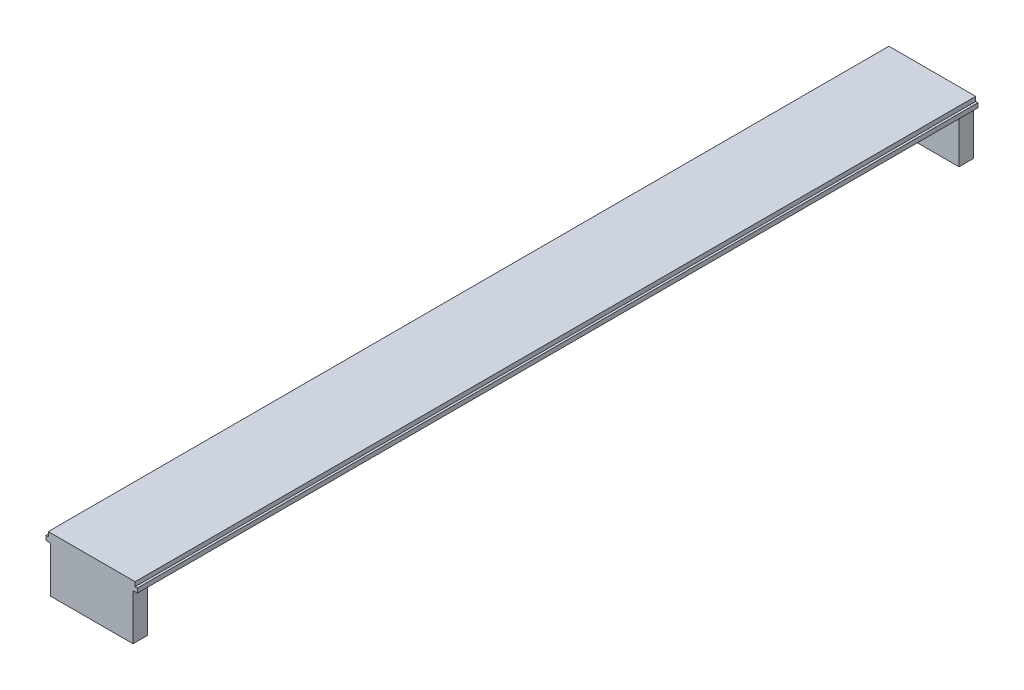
ISO-10303-21;
HEADER;
FILE_DESCRIPTION(('STEP AP214'),'2;1');
FILE_NAME('part.step','',(''),(''),'','','');
FILE_SCHEMA(('AUTOMOTIVE_DESIGN { 1 0 10303 214 1 1 1 1 }'));
ENDSEC;
DATA;
#1=APPLICATION_CONTEXT('core data for automotive mechanical design processes');
#2=APPLICATION_PROTOCOL_DEFINITION('international standard','automotive_design',2000,#1);
#3=PRODUCT_CONTEXT('',#1,'mechanical');
#4=PRODUCT('Part','Part','',(#3));
#5=PRODUCT_RELATED_PRODUCT_CATEGORY('part','',(#4));
#6=PRODUCT_DEFINITION_FORMATION('','',#4);
#7=PRODUCT_DEFINITION_CONTEXT('part definition',#1,'design');
#8=PRODUCT_DEFINITION('design','',#6,#7);
#9=PRODUCT_DEFINITION_SHAPE('','',#8);
#10=(LENGTH_UNIT() NAMED_UNIT(*) SI_UNIT(.MILLI.,.METRE.));
#11=(NAMED_UNIT(*) PLANE_ANGLE_UNIT() SI_UNIT($,.RADIAN.));
#12=(NAMED_UNIT(*) SI_UNIT($,.STERADIAN.) SOLID_ANGLE_UNIT());
#13=UNCERTAINTY_MEASURE_WITH_UNIT(LENGTH_MEASURE(1.E-05),#10,'distance_accuracy_value','');
#14=(GEOMETRIC_REPRESENTATION_CONTEXT(3) GLOBAL_UNCERTAINTY_ASSIGNED_CONTEXT((#13)) GLOBAL_UNIT_ASSIGNED_CONTEXT((#10,
#11,#12)) REPRESENTATION_CONTEXT('',''));
#15=CARTESIAN_POINT('',(0.,0.,0.));
#16=DIRECTION('',(0.,0.,1.));
#17=DIRECTION('',(1.,0.,0.));
#18=AXIS2_PLACEMENT_3D('',#15,#16,#17);
#19=CARTESIAN_POINT('',(0.,0.,146.05));
#20=DIRECTION('',(0.,1.,0.));
#21=DIRECTION('',(0.,0.,1.));
#22=AXIS2_PLACEMENT_3D('',#19,#20,#21);
#23=PLANE('',#22);
#24=DIRECTION('',(0.,0.,1.));
#25=VECTOR('',#24,1.);
#26=CARTESIAN_POINT('',(15.113,0.,0.));
#27=LINE('',#26,#25);
#28=CARTESIAN_POINT('',(15.113,0.,0.));
#29=VERTEX_POINT('',#28);
#30=CARTESIAN_POINT('',(15.113,0.,2.53999999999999));
#31=VERTEX_POINT('',#30);
#32=EDGE_CURVE('E319',#29,#31,#27,.T.);
#33=ORIENTED_EDGE('',*,*,#32,.F.);
#34=DIRECTION('',(1.,0.,0.));
#35=VECTOR('',#34,1.);
#36=CARTESIAN_POINT('',(0.,0.,0.));
#37=LINE('',#36,#35);
#38=CARTESIAN_POINT('',(15.875,0.,0.));
#39=VERTEX_POINT('',#38);
#40=EDGE_CURVE('E172',#29,#39,#37,.T.);
#41=ORIENTED_EDGE('',*,*,#40,.T.);
#42=DIRECTION('',(0.,0.,-1.));
#43=VECTOR('',#42,1.);
#44=CARTESIAN_POINT('',(15.875,0.,146.05));
#45=LINE('',#44,#43);
#46=CARTESIAN_POINT('',(15.875,0.,146.05));
#47=VERTEX_POINT('',#46);
#48=EDGE_CURVE('E44',#47,#39,#45,.T.);
#49=ORIENTED_EDGE('',*,*,#48,.F.);
#50=DIRECTION('',(1.,0.,0.));
#51=VECTOR('',#50,1.);
#52=CARTESIAN_POINT('',(0.,0.,146.05));
#53=LINE('',#52,#51);
#54=CARTESIAN_POINT('',(15.113,0.,146.05));
#55=VERTEX_POINT('',#54);
#56=EDGE_CURVE('E218',#55,#47,#53,.T.);
#57=ORIENTED_EDGE('',*,*,#56,.F.);
#58=DIRECTION('',(0.,0.,1.));
#59=VECTOR('',#58,1.);
#60=CARTESIAN_POINT('',(15.113,0.,146.05));
#61=LINE('',#60,#59);
#62=CARTESIAN_POINT('',(15.113,0.,143.51));
#63=VERTEX_POINT('',#62);
#64=EDGE_CURVE('E186',#63,#55,#61,.T.);
#65=ORIENTED_EDGE('',*,*,#64,.F.);
#66=DIRECTION('',(1.,0.,0.));
#67=VECTOR('',#66,1.);
#68=CARTESIAN_POINT('',(0.762000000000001,0.,143.51));
#69=LINE('',#68,#67);
#70=CARTESIAN_POINT('',(0.762000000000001,0.,143.51));
#71=VERTEX_POINT('',#70);
#72=EDGE_CURVE('E176',#71,#63,#69,.T.);
#73=ORIENTED_EDGE('',*,*,#72,.F.);
#74=DIRECTION('',(0.,0.,-1.));
#75=VECTOR('',#74,1.);
#76=CARTESIAN_POINT('',(0.762000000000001,0.,146.05));
#77=LINE('',#76,#75);
#78=CARTESIAN_POINT('',(0.762000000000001,0.,146.05));
#79=VERTEX_POINT('',#78);
#80=EDGE_CURVE('E173',#79,#71,#77,.T.);
#81=ORIENTED_EDGE('',*,*,#80,.F.);
#82=CARTESIAN_POINT('',(0.,0.,146.05));
#83=VERTEX_POINT('',#82);
#84=EDGE_CURVE('E221',#83,#79,#53,.T.);
#85=ORIENTED_EDGE('',*,*,#84,.F.);
#86=DIRECTION('',(0.,0.,-1.));
#87=VECTOR('',#86,1.);
#88=CARTESIAN_POINT('',(0.,0.,146.05));
#89=LINE('',#88,#87);
#90=CARTESIAN_POINT('',(0.,0.,0.));
#91=VERTEX_POINT('',#90);
#92=EDGE_CURVE('E11',#83,#91,#89,.T.);
#93=ORIENTED_EDGE('',*,*,#92,.T.);
#94=CARTESIAN_POINT('',(0.762000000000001,0.,0.));
#95=VERTEX_POINT('',#94);
#96=EDGE_CURVE('E243',#91,#95,#37,.T.);
#97=ORIENTED_EDGE('',*,*,#96,.T.);
#98=DIRECTION('',(0.,0.,-1.));
#99=VECTOR('',#98,1.);
#100=CARTESIAN_POINT('',(0.762000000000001,0.,0.));
#101=LINE('',#100,#99);
#102=CARTESIAN_POINT('',(0.762000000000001,0.,2.53999999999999));
#103=VERTEX_POINT('',#102);
#104=EDGE_CURVE('E57',#103,#95,#101,.T.);
#105=ORIENTED_EDGE('',*,*,#104,.F.);
#106=DIRECTION('',(-1.,0.,0.));
#107=VECTOR('',#106,1.);
#108=CARTESIAN_POINT('',(0.762000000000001,0.,2.53999999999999));
#109=LINE('',#108,#107);
#110=EDGE_CURVE('E52',#31,#103,#109,.T.);
#111=ORIENTED_EDGE('',*,*,#110,.F.);
#112=EDGE_LOOP('',(#33,#41,#49,#57,#65,#73,#81,#85,#93,#97,#105,#111));
#113=FACE_BOUND('',#112,.T.);
#114=ADVANCED_FACE('F35',(#113),#23,.F.);
#115=CARTESIAN_POINT('',(0.,0.,146.05));
#116=DIRECTION('',(1.,0.,0.));
#117=DIRECTION('',(0.,0.,-1.));
#118=AXIS2_PLACEMENT_3D('',#115,#116,#117);
#119=PLANE('',#118);
#120=DIRECTION('',(0.,-1.,0.));
#121=VECTOR('',#120,1.);
#122=CARTESIAN_POINT('',(0.,0.,0.));
#123=LINE('',#122,#121);
#124=CARTESIAN_POINT('',(0.,0.762,0.));
#125=VERTEX_POINT('',#124);
#126=EDGE_CURVE('E240',#125,#91,#123,.T.);
#127=ORIENTED_EDGE('',*,*,#126,.T.);
#128=ORIENTED_EDGE('',*,*,#92,.F.);
#129=DIRECTION('',(0.,-1.,0.));
#130=VECTOR('',#129,1.);
#131=CARTESIAN_POINT('',(0.,0.,146.05));
#132=LINE('',#131,#130);
#133=CARTESIAN_POINT('',(0.,0.762,146.05));
#134=VERTEX_POINT('',#133);
#135=EDGE_CURVE('E222',#134,#83,#132,.T.);
#136=ORIENTED_EDGE('',*,*,#135,.F.);
#137=DIRECTION('',(0.,0.,-1.));
#138=VECTOR('',#137,1.);
#139=CARTESIAN_POINT('',(0.,0.762,146.05));
#140=LINE('',#139,#138);
#141=EDGE_CURVE('E239',#134,#125,#140,.T.);
#142=ORIENTED_EDGE('',*,*,#141,.T.);
#143=EDGE_LOOP('',(#127,#128,#136,#142));
#144=FACE_BOUND('',#143,.T.);
#145=ADVANCED_FACE('F37',(#144),#119,.F.);
#146=CARTESIAN_POINT('',(15.875,0.,146.05));
#147=DIRECTION('',(-1.,0.,0.));
#148=DIRECTION('',(0.,0.,1.));
#149=AXIS2_PLACEMENT_3D('',#146,#147,#148);
#150=PLANE('',#149);
#151=DIRECTION('',(0.,1.,0.));
#152=VECTOR('',#151,1.);
#153=CARTESIAN_POINT('',(15.875,0.,0.));
#154=LINE('',#153,#152);
#155=CARTESIAN_POINT('',(15.875,0.762,0.));
#156=VERTEX_POINT('',#155);
#157=EDGE_CURVE('E245',#39,#156,#154,.T.);
#158=ORIENTED_EDGE('',*,*,#157,.T.);
#159=DIRECTION('',(0.,0.,-1.));
#160=VECTOR('',#159,1.);
#161=CARTESIAN_POINT('',(15.875,0.762,146.05));
#162=LINE('',#161,#160);
#163=CARTESIAN_POINT('',(15.875,0.762,146.05));
#164=VERTEX_POINT('',#163);
#165=EDGE_CURVE('E271',#164,#156,#162,.T.);
#166=ORIENTED_EDGE('',*,*,#165,.F.);
#167=DIRECTION('',(0.,1.,0.));
#168=VECTOR('',#167,1.);
#169=CARTESIAN_POINT('',(15.875,0.,146.05));
#170=LINE('',#169,#168);
#171=EDGE_CURVE('E226',#47,#164,#170,.T.);
#172=ORIENTED_EDGE('',*,*,#171,.F.);
#173=ORIENTED_EDGE('',*,*,#48,.T.);
#174=EDGE_LOOP('',(#158,#166,#172,#173));
#175=FACE_BOUND('',#174,.T.);
#176=ADVANCED_FACE('F278',(#175),#150,.F.);
#177=CARTESIAN_POINT('',(15.875,0.762,146.05));
#178=DIRECTION('',(0.,-1.,0.));
#179=DIRECTION('',(0.,0.,-1.));
#180=AXIS2_PLACEMENT_3D('',#177,#178,#179);
#181=PLANE('',#180);
#182=DIRECTION('',(-1.,0.,0.));
#183=VECTOR('',#182,1.);
#184=CARTESIAN_POINT('',(15.875,0.762,0.));
#185=LINE('',#184,#183);
#186=CARTESIAN_POINT('',(15.4813,0.762,0.));
#187=VERTEX_POINT('',#186);
#188=EDGE_CURVE('E247',#156,#187,#185,.T.);
#189=ORIENTED_EDGE('',*,*,#188,.T.);
#190=DIRECTION('',(0.,0.,-1.));
#191=VECTOR('',#190,1.);
#192=CARTESIAN_POINT('',(15.4813,0.762,146.05));
#193=LINE('',#192,#191);
#194=CARTESIAN_POINT('',(15.4813,0.762,146.05));
#195=VERTEX_POINT('',#194);
#196=EDGE_CURVE('E268',#195,#187,#193,.T.);
#197=ORIENTED_EDGE('',*,*,#196,.F.);
#198=DIRECTION('',(-1.,0.,0.));
#199=VECTOR('',#198,1.);
#200=CARTESIAN_POINT('',(15.875,0.762,146.05));
#201=LINE('',#200,#199);
#202=EDGE_CURVE('E229',#164,#195,#201,.T.);
#203=ORIENTED_EDGE('',*,*,#202,.F.);
#204=ORIENTED_EDGE('',*,*,#165,.T.);
#205=EDGE_LOOP('',(#189,#197,#203,#204));
#206=FACE_BOUND('',#205,.T.);
#207=ADVANCED_FACE('F285',(#206),#181,.F.);
#208=CARTESIAN_POINT('',(15.4813,1.524,146.05));
#209=DIRECTION('',(-1.,0.,0.));
#210=DIRECTION('',(0.,0.,1.));
#211=AXIS2_PLACEMENT_3D('',#208,#209,#210);
#212=PLANE('',#211);
#213=DIRECTION('',(0.,1.,0.));
#214=VECTOR('',#213,1.);
#215=CARTESIAN_POINT('',(15.4813,1.524,0.));
#216=LINE('',#215,#214);
#217=CARTESIAN_POINT('',(15.4813,1.524,0.));
#218=VERTEX_POINT('',#217);
#219=EDGE_CURVE('E249',#187,#218,#216,.T.);
#220=ORIENTED_EDGE('',*,*,#219,.T.);
#221=DIRECTION('',(0.,0.,-1.));
#222=VECTOR('',#221,1.);
#223=CARTESIAN_POINT('',(15.4813,1.524,146.05));
#224=LINE('',#223,#222);
#225=CARTESIAN_POINT('',(15.4813,1.524,146.05));
#226=VERTEX_POINT('',#225);
#227=EDGE_CURVE('E265',#226,#218,#224,.T.);
#228=ORIENTED_EDGE('',*,*,#227,.F.);
#229=DIRECTION('',(0.,1.,0.));
#230=VECTOR('',#229,1.);
#231=CARTESIAN_POINT('',(15.4813,1.524,146.05));
#232=LINE('',#231,#230);
#233=EDGE_CURVE('E231',#195,#226,#232,.T.);
#234=ORIENTED_EDGE('',*,*,#233,.F.);
#235=ORIENTED_EDGE('',*,*,#196,.T.);
#236=EDGE_LOOP('',(#220,#228,#234,#235));
#237=FACE_BOUND('',#236,.T.);
#238=ADVANCED_FACE('F289',(#237),#212,.F.);
#239=CARTESIAN_POINT('',(0.393699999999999,1.524,146.05));
#240=DIRECTION('',(0.,-1.,0.));
#241=DIRECTION('',(1.,0.,0.));
#242=AXIS2_PLACEMENT_3D('',#239,#240,#241);
#243=PLANE('',#242);
#244=DIRECTION('',(-1.,0.,0.));
#245=VECTOR('',#244,1.);
#246=CARTESIAN_POINT('',(0.393699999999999,1.524,0.));
#247=LINE('',#246,#245);
#248=CARTESIAN_POINT('',(0.393699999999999,1.524,0.));
#249=VERTEX_POINT('',#248);
#250=EDGE_CURVE('E251',#218,#249,#247,.T.);
#251=ORIENTED_EDGE('',*,*,#250,.T.);
#252=DIRECTION('',(0.,0.,-1.));
#253=VECTOR('',#252,1.);
#254=CARTESIAN_POINT('',(0.393699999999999,1.524,146.05));
#255=LINE('',#254,#253);
#256=CARTESIAN_POINT('',(0.393699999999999,1.524,146.05));
#257=VERTEX_POINT('',#256);
#258=EDGE_CURVE('E262',#257,#249,#255,.T.);
#259=ORIENTED_EDGE('',*,*,#258,.F.);
#260=DIRECTION('',(-1.,0.,0.));
#261=VECTOR('',#260,1.);
#262=CARTESIAN_POINT('',(0.393699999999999,1.524,146.05));
#263=LINE('',#262,#261);
#264=EDGE_CURVE('E233',#226,#257,#263,.T.);
#265=ORIENTED_EDGE('',*,*,#264,.F.);
#266=ORIENTED_EDGE('',*,*,#227,.T.);
#267=EDGE_LOOP('',(#251,#259,#265,#266));
#268=FACE_BOUND('',#267,.T.);
#269=ADVANCED_FACE('F358',(#268),#243,.F.);
#270=CARTESIAN_POINT('',(0.393699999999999,1.524,146.05));
#271=DIRECTION('',(1.,0.,0.));
#272=DIRECTION('',(0.,0.,-1.));
#273=AXIS2_PLACEMENT_3D('',#270,#271,#272);
#274=PLANE('',#273);
#275=DIRECTION('',(0.,-1.,0.));
#276=VECTOR('',#275,1.);
#277=CARTESIAN_POINT('',(0.393699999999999,1.524,0.));
#278=LINE('',#277,#276);
#279=CARTESIAN_POINT('',(0.393699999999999,0.762,0.));
#280=VERTEX_POINT('',#279);
#281=EDGE_CURVE('E253',#249,#280,#278,.T.);
#282=ORIENTED_EDGE('',*,*,#281,.T.);
#283=DIRECTION('',(0.,0.,-1.));
#284=VECTOR('',#283,1.);
#285=CARTESIAN_POINT('',(0.393699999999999,0.762,146.05));
#286=LINE('',#285,#284);
#287=CARTESIAN_POINT('',(0.393699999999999,0.762,146.05));
#288=VERTEX_POINT('',#287);
#289=EDGE_CURVE('E259',#288,#280,#286,.T.);
#290=ORIENTED_EDGE('',*,*,#289,.F.);
#291=DIRECTION('',(0.,-1.,0.));
#292=VECTOR('',#291,1.);
#293=CARTESIAN_POINT('',(0.393699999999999,1.524,146.05));
#294=LINE('',#293,#292);
#295=EDGE_CURVE('E235',#257,#288,#294,.T.);
#296=ORIENTED_EDGE('',*,*,#295,.F.);
#297=ORIENTED_EDGE('',*,*,#258,.T.);
#298=EDGE_LOOP('',(#282,#290,#296,#297));
#299=FACE_BOUND('',#298,.T.);
#300=ADVANCED_FACE('F361',(#299),#274,.F.);
#301=CARTESIAN_POINT('',(0.,0.762,146.05));
#302=DIRECTION('',(0.,-1.,0.));
#303=DIRECTION('',(0.,0.,-1.));
#304=AXIS2_PLACEMENT_3D('',#301,#302,#303);
#305=PLANE('',#304);
#306=DIRECTION('',(-1.,0.,0.));
#307=VECTOR('',#306,1.);
#308=CARTESIAN_POINT('',(0.,0.762,0.));
#309=LINE('',#308,#307);
#310=EDGE_CURVE('E255',#280,#125,#309,.T.);
#311=ORIENTED_EDGE('',*,*,#310,.T.);
#312=ORIENTED_EDGE('',*,*,#141,.F.);
#313=DIRECTION('',(-1.,0.,0.));
#314=VECTOR('',#313,1.);
#315=CARTESIAN_POINT('',(0.,0.762,146.05));
#316=LINE('',#315,#314);
#317=EDGE_CURVE('E237',#288,#134,#316,.T.);
#318=ORIENTED_EDGE('',*,*,#317,.F.);
#319=ORIENTED_EDGE('',*,*,#289,.T.);
#320=EDGE_LOOP('',(#311,#312,#318,#319));
#321=FACE_BOUND('',#320,.T.);
#322=ADVANCED_FACE('F365',(#321),#305,.F.);
#323=CARTESIAN_POINT('',(0.,0.,146.05));
#324=DIRECTION('',(0.,0.,-1.));
#325=DIRECTION('',(-1.,0.,0.));
#326=AXIS2_PLACEMENT_3D('',#323,#324,#325);
#327=PLANE('',#326);
#328=ORIENTED_EDGE('',*,*,#135,.T.);
#329=ORIENTED_EDGE('',*,*,#84,.T.);
#330=DIRECTION('',(0.,1.,0.));
#331=VECTOR('',#330,1.);
#332=CARTESIAN_POINT('',(0.762000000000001,-8.001,146.05));
#333=LINE('',#332,#331);
#334=CARTESIAN_POINT('',(0.762000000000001,-8.001,146.05));
#335=VERTEX_POINT('',#334);
#336=EDGE_CURVE('E192',#335,#79,#333,.T.);
#337=ORIENTED_EDGE('',*,*,#336,.F.);
#338=DIRECTION('',(-1.,0.,0.));
#339=VECTOR('',#338,1.);
#340=CARTESIAN_POINT('',(0.762000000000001,-8.001,146.05));
#341=LINE('',#340,#339);
#342=CARTESIAN_POINT('',(15.113,-8.001,146.05));
#343=VERTEX_POINT('',#342);
#344=EDGE_CURVE('E190',#343,#335,#341,.T.);
#345=ORIENTED_EDGE('',*,*,#344,.F.);
#346=DIRECTION('',(0.,1.,0.));
#347=VECTOR('',#346,1.);
#348=CARTESIAN_POINT('',(15.113,-8.001,146.05));
#349=LINE('',#348,#347);
#350=EDGE_CURVE('E204',#343,#55,#349,.T.);
#351=ORIENTED_EDGE('',*,*,#350,.T.);
#352=ORIENTED_EDGE('',*,*,#56,.T.);
#353=ORIENTED_EDGE('',*,*,#171,.T.);
#354=ORIENTED_EDGE('',*,*,#202,.T.);
#355=ORIENTED_EDGE('',*,*,#233,.T.);
#356=ORIENTED_EDGE('',*,*,#264,.T.);
#357=ORIENTED_EDGE('',*,*,#295,.T.);
#358=ORIENTED_EDGE('',*,*,#317,.T.);
#359=EDGE_LOOP('',(#328,#329,#337,#345,#351,#352,#353,#354,#355,#356,#357,#358));
#360=FACE_BOUND('',#359,.T.);
#361=ADVANCED_FACE('F293',(#360),#327,.F.);
#362=CARTESIAN_POINT('',(0.,0.,0.));
#363=DIRECTION('',(0.,0.,-1.));
#364=DIRECTION('',(-1.,0.,0.));
#365=AXIS2_PLACEMENT_3D('',#362,#363,#364);
#366=PLANE('',#365);
#367=CARTESIAN_POINT('',(7.9375,-3.2385,0.));
#368=DIRECTION('',(0.,0.,1.));
#369=DIRECTION('',(1.,0.,0.));
#370=AXIS2_PLACEMENT_3D('',#367,#368,#369);
#371=CIRCLE('',#370,2.38125);
#372=CARTESIAN_POINT('',(10.31875,-3.2385,0.));
#373=VERTEX_POINT('',#372);
#374=EDGE_CURVE('E320',#373,#373,#371,.T.);
#375=ORIENTED_EDGE('',*,*,#374,.T.);
#376=EDGE_LOOP('',(#375));
#377=FACE_BOUND('',#376,.T.);
#378=ORIENTED_EDGE('',*,*,#126,.F.);
#379=ORIENTED_EDGE('',*,*,#310,.F.);
#380=ORIENTED_EDGE('',*,*,#281,.F.);
#381=ORIENTED_EDGE('',*,*,#250,.F.);
#382=ORIENTED_EDGE('',*,*,#219,.F.);
#383=ORIENTED_EDGE('',*,*,#188,.F.);
#384=ORIENTED_EDGE('',*,*,#157,.F.);
#385=ORIENTED_EDGE('',*,*,#40,.F.);
#386=DIRECTION('',(0.,1.,0.));
#387=VECTOR('',#386,1.);
#388=CARTESIAN_POINT('',(15.113,-8.001,0.));
#389=LINE('',#388,#387);
#390=CARTESIAN_POINT('',(15.113,-8.001,0.));
#391=VERTEX_POINT('',#390);
#392=EDGE_CURVE('E153',#391,#29,#389,.T.);
#393=ORIENTED_EDGE('',*,*,#392,.F.);
#394=DIRECTION('',(1.,0.,0.));
#395=VECTOR('',#394,1.);
#396=CARTESIAN_POINT('',(0.762000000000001,-8.001,0.));
#397=LINE('',#396,#395);
#398=CARTESIAN_POINT('',(0.762000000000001,-8.001,0.));
#399=VERTEX_POINT('',#398);
#400=EDGE_CURVE('E159',#399,#391,#397,.T.);
#401=ORIENTED_EDGE('',*,*,#400,.F.);
#402=DIRECTION('',(0.,1.,0.));
#403=VECTOR('',#402,1.);
#404=CARTESIAN_POINT('',(0.762000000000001,-8.001,0.));
#405=LINE('',#404,#403);
#406=EDGE_CURVE('E312',#399,#95,#405,.T.);
#407=ORIENTED_EDGE('',*,*,#406,.T.);
#408=ORIENTED_EDGE('',*,*,#96,.F.);
#409=EDGE_LOOP('',(#378,#379,#380,#381,#382,#383,#384,#385,#393,#401,#407,#408));
#410=FACE_BOUND('',#409,.T.);
#411=ADVANCED_FACE('F170',(#377,#410),#366,.T.);
#412=CARTESIAN_POINT('',(0.762000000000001,-8.001,146.05));
#413=DIRECTION('',(1.,0.,0.));
#414=DIRECTION('',(0.,0.,-1.));
#415=AXIS2_PLACEMENT_3D('',#412,#413,#414);
#416=PLANE('',#415);
#417=ORIENTED_EDGE('',*,*,#80,.T.);
#418=DIRECTION('',(0.,1.,0.));
#419=VECTOR('',#418,1.);
#420=CARTESIAN_POINT('',(0.762000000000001,-8.001,143.51));
#421=LINE('',#420,#419);
#422=CARTESIAN_POINT('',(0.762000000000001,-8.001,143.51));
#423=VERTEX_POINT('',#422);
#424=EDGE_CURVE('E210',#423,#71,#421,.T.);
#425=ORIENTED_EDGE('',*,*,#424,.F.);
#426=DIRECTION('',(0.,0.,-1.));
#427=VECTOR('',#426,1.);
#428=CARTESIAN_POINT('',(0.762000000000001,-8.001,146.05));
#429=LINE('',#428,#427);
#430=EDGE_CURVE('E182',#335,#423,#429,.T.);
#431=ORIENTED_EDGE('',*,*,#430,.F.);
#432=ORIENTED_EDGE('',*,*,#336,.T.);
#433=EDGE_LOOP('',(#417,#425,#431,#432));
#434=FACE_BOUND('',#433,.T.);
#435=ADVANCED_FACE('F372',(#434),#416,.F.);
#436=CARTESIAN_POINT('',(0.762000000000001,-8.001,143.51));
#437=DIRECTION('',(0.,0.,1.));
#438=DIRECTION('',(1.,0.,0.));
#439=AXIS2_PLACEMENT_3D('',#436,#437,#438);
#440=PLANE('',#439);
#441=ORIENTED_EDGE('',*,*,#72,.T.);
#442=DIRECTION('',(0.,1.,0.));
#443=VECTOR('',#442,1.);
#444=CARTESIAN_POINT('',(15.113,-8.001,143.51));
#445=LINE('',#444,#443);
#446=CARTESIAN_POINT('',(15.113,-8.001,143.51));
#447=VERTEX_POINT('',#446);
#448=EDGE_CURVE('E197',#447,#63,#445,.T.);
#449=ORIENTED_EDGE('',*,*,#448,.F.);
#450=DIRECTION('',(1.,0.,0.));
#451=VECTOR('',#450,1.);
#452=CARTESIAN_POINT('',(0.762000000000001,-8.001,143.51));
#453=LINE('',#452,#451);
#454=EDGE_CURVE('E185',#423,#447,#453,.T.);
#455=ORIENTED_EDGE('',*,*,#454,.F.);
#456=ORIENTED_EDGE('',*,*,#424,.T.);
#457=EDGE_LOOP('',(#441,#449,#455,#456));
#458=FACE_BOUND('',#457,.T.);
#459=ADVANCED_FACE('F300',(#458),#440,.F.);
#460=CARTESIAN_POINT('',(15.113,-8.001,146.05));
#461=DIRECTION('',(-1.,0.,0.));
#462=DIRECTION('',(0.,0.,1.));
#463=AXIS2_PLACEMENT_3D('',#460,#461,#462);
#464=PLANE('',#463);
#465=ORIENTED_EDGE('',*,*,#64,.T.);
#466=ORIENTED_EDGE('',*,*,#350,.F.);
#467=DIRECTION('',(0.,0.,1.));
#468=VECTOR('',#467,1.);
#469=CARTESIAN_POINT('',(15.113,-8.001,146.05));
#470=LINE('',#469,#468);
#471=EDGE_CURVE('E188',#447,#343,#470,.T.);
#472=ORIENTED_EDGE('',*,*,#471,.F.);
#473=ORIENTED_EDGE('',*,*,#448,.T.);
#474=EDGE_LOOP('',(#465,#466,#472,#473));
#475=FACE_BOUND('',#474,.T.);
#476=ADVANCED_FACE('F296',(#475),#464,.F.);
#477=CARTESIAN_POINT('',(0.,-8.001,0.));
#478=DIRECTION('',(0.,-1.,0.));
#479=DIRECTION('',(0.,0.,-1.));
#480=AXIS2_PLACEMENT_3D('',#477,#478,#479);
#481=PLANE('',#480);
#482=ORIENTED_EDGE('',*,*,#430,.T.);
#483=ORIENTED_EDGE('',*,*,#454,.T.);
#484=ORIENTED_EDGE('',*,*,#471,.T.);
#485=ORIENTED_EDGE('',*,*,#344,.T.);
#486=EDGE_LOOP('',(#482,#483,#484,#485));
#487=FACE_BOUND('',#486,.T.);
#488=ADVANCED_FACE('F345',(#487),#481,.T.);
#489=CARTESIAN_POINT('',(15.113,-8.001,0.));
#490=DIRECTION('',(-1.,0.,0.));
#491=DIRECTION('',(0.,0.,1.));
#492=AXIS2_PLACEMENT_3D('',#489,#490,#491);
#493=PLANE('',#492);
#494=ORIENTED_EDGE('',*,*,#32,.T.);
#495=DIRECTION('',(0.,1.,0.));
#496=VECTOR('',#495,1.);
#497=CARTESIAN_POINT('',(15.113,-8.001,2.53999999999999));
#498=LINE('',#497,#496);
#499=CARTESIAN_POINT('',(15.113,-8.001,2.53999999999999));
#500=VERTEX_POINT('',#499);
#501=EDGE_CURVE('E155',#500,#31,#498,.T.);
#502=ORIENTED_EDGE('',*,*,#501,.F.);
#503=DIRECTION('',(0.,0.,1.));
#504=VECTOR('',#503,1.);
#505=CARTESIAN_POINT('',(15.113,-8.001,0.));
#506=LINE('',#505,#504);
#507=EDGE_CURVE('E149',#391,#500,#506,.T.);
#508=ORIENTED_EDGE('',*,*,#507,.F.);
#509=ORIENTED_EDGE('',*,*,#392,.T.);
#510=EDGE_LOOP('',(#494,#502,#508,#509));
#511=FACE_BOUND('',#510,.T.);
#512=ADVANCED_FACE('F151',(#511),#493,.F.);
#513=CARTESIAN_POINT('',(0.762000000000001,-8.001,2.53999999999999));
#514=DIRECTION('',(0.,0.,-1.));
#515=DIRECTION('',(-1.,0.,0.));
#516=AXIS2_PLACEMENT_3D('',#513,#514,#515);
#517=PLANE('',#516);
#518=CARTESIAN_POINT('',(7.9375,-3.2385,2.53999999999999));
#519=DIRECTION('',(0.,0.,1.));
#520=DIRECTION('',(1.,0.,0.));
#521=AXIS2_PLACEMENT_3D('',#518,#519,#520);
#522=CIRCLE('',#521,2.38125);
#523=CARTESIAN_POINT('',(10.31875,-3.2385,2.53999999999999));
#524=VERTEX_POINT('',#523);
#525=EDGE_CURVE('E323',#524,#524,#522,.T.);
#526=ORIENTED_EDGE('',*,*,#525,.F.);
#527=EDGE_LOOP('',(#526));
#528=FACE_BOUND('',#527,.T.);
#529=ORIENTED_EDGE('',*,*,#110,.T.);
#530=DIRECTION('',(0.,1.,0.));
#531=VECTOR('',#530,1.);
#532=CARTESIAN_POINT('',(0.762000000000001,-8.001,2.53999999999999));
#533=LINE('',#532,#531);
#534=CARTESIAN_POINT('',(0.762000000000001,-8.001,2.53999999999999));
#535=VERTEX_POINT('',#534);
#536=EDGE_CURVE('E178',#535,#103,#533,.T.);
#537=ORIENTED_EDGE('',*,*,#536,.F.);
#538=DIRECTION('',(-1.,0.,0.));
#539=VECTOR('',#538,1.);
#540=CARTESIAN_POINT('',(0.762000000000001,-8.001,2.53999999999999));
#541=LINE('',#540,#539);
#542=EDGE_CURVE('E158',#500,#535,#541,.T.);
#543=ORIENTED_EDGE('',*,*,#542,.F.);
#544=ORIENTED_EDGE('',*,*,#501,.T.);
#545=EDGE_LOOP('',(#529,#537,#543,#544));
#546=FACE_BOUND('',#545,.T.);
#547=ADVANCED_FACE('F336',(#528,#546),#517,.F.);
#548=CARTESIAN_POINT('',(0.762000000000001,-8.001,0.));
#549=DIRECTION('',(1.,0.,0.));
#550=DIRECTION('',(0.,0.,-1.));
#551=AXIS2_PLACEMENT_3D('',#548,#549,#550);
#552=PLANE('',#551);
#553=ORIENTED_EDGE('',*,*,#104,.T.);
#554=ORIENTED_EDGE('',*,*,#406,.F.);
#555=DIRECTION('',(0.,0.,-1.));
#556=VECTOR('',#555,1.);
#557=CARTESIAN_POINT('',(0.762000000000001,-8.001,0.));
#558=LINE('',#557,#556);
#559=EDGE_CURVE('E164',#535,#399,#558,.T.);
#560=ORIENTED_EDGE('',*,*,#559,.F.);
#561=ORIENTED_EDGE('',*,*,#536,.T.);
#562=EDGE_LOOP('',(#553,#554,#560,#561));
#563=FACE_BOUND('',#562,.T.);
#564=ADVANCED_FACE('F311',(#563),#552,.F.);
#565=CARTESIAN_POINT('',(0.,-8.001,0.));
#566=DIRECTION('',(0.,-1.,0.));
#567=DIRECTION('',(0.,0.,-1.));
#568=AXIS2_PLACEMENT_3D('',#565,#566,#567);
#569=PLANE('',#568);
#570=ORIENTED_EDGE('',*,*,#400,.T.);
#571=ORIENTED_EDGE('',*,*,#507,.T.);
#572=ORIENTED_EDGE('',*,*,#542,.T.);
#573=ORIENTED_EDGE('',*,*,#559,.T.);
#574=EDGE_LOOP('',(#570,#571,#572,#573));
#575=FACE_BOUND('',#574,.T.);
#576=ADVANCED_FACE('F162',(#575),#569,.T.);
#577=CARTESIAN_POINT('',(7.9375,-3.2385,0.));
#578=DIRECTION('',(0.,0.,1.));
#579=DIRECTION('',(1.,0.,0.));
#580=AXIS2_PLACEMENT_3D('',#577,#578,#579);
#581=CYLINDRICAL_SURFACE('',#580,2.38125);
#582=ORIENTED_EDGE('',*,*,#374,.F.);
#583=EDGE_LOOP('',(#582));
#584=FACE_BOUND('',#583,.T.);
#585=ORIENTED_EDGE('',*,*,#525,.T.);
#586=EDGE_LOOP('',(#585));
#587=FACE_BOUND('',#586,.T.);
#588=ADVANCED_FACE('F330',(#584,#587),#581,.F.);
#589=CLOSED_SHELL('',(#114,#145,#176,#207,#238,#269,#300,#322,#361,#411,#435,#459,#476,#488,
#512,#547,#564,#576,#588));
#590=MANIFOLD_SOLID_BREP('B2',#589);
#591=ADVANCED_BREP_SHAPE_REPRESENTATION('',(#18,#590),#14);
#592=SHAPE_DEFINITION_REPRESENTATION(#9,#591);
ENDSEC;
END-ISO-10303-21;
